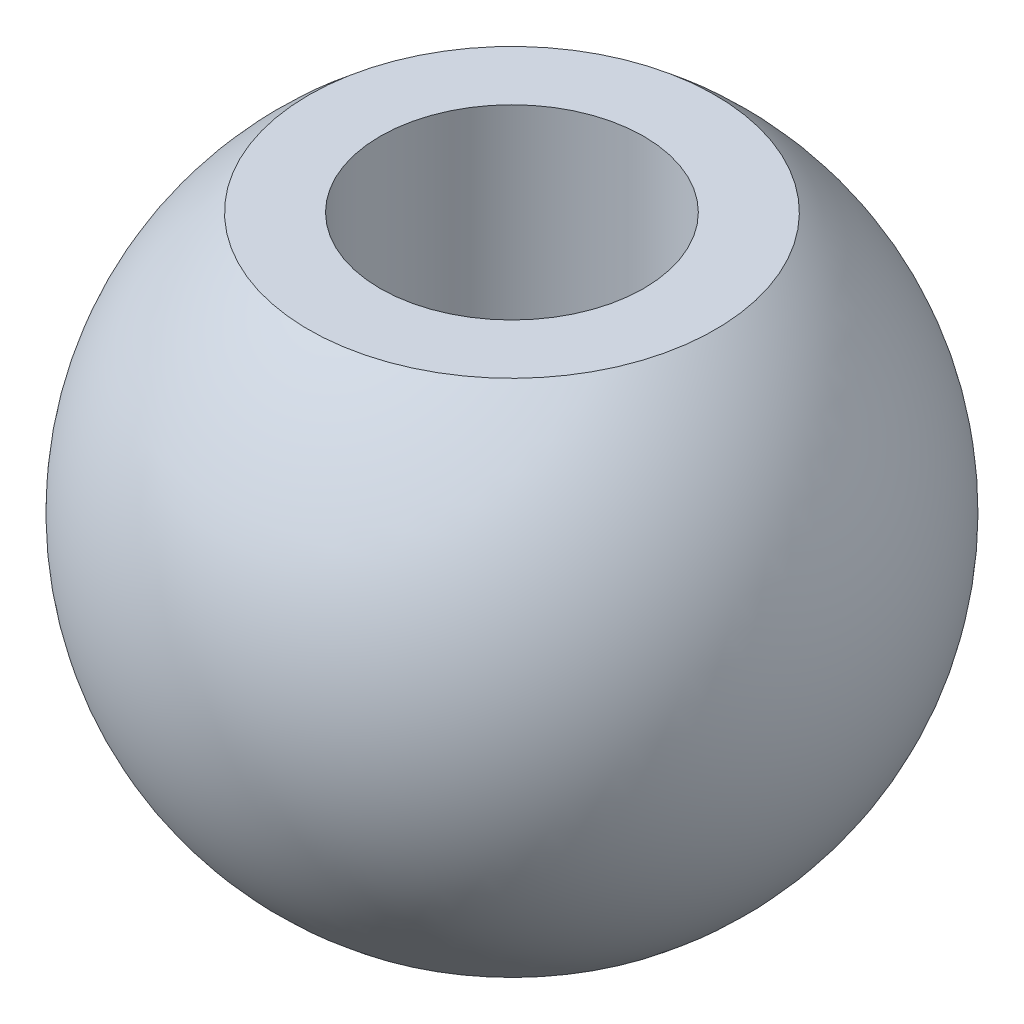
ISO-10303-21;
HEADER;
FILE_DESCRIPTION(('STEP AP214'),'2;1');
FILE_NAME('part.step','',(''),(''),'','','');
FILE_SCHEMA(('AUTOMOTIVE_DESIGN { 1 0 10303 214 1 1 1 1 }'));
ENDSEC;
DATA;
#1=APPLICATION_CONTEXT('core data for automotive mechanical design processes');
#2=APPLICATION_PROTOCOL_DEFINITION('international standard','automotive_design',2000,#1);
#3=PRODUCT_CONTEXT('',#1,'mechanical');
#4=PRODUCT('Part','Part','',(#3));
#5=PRODUCT_RELATED_PRODUCT_CATEGORY('part','',(#4));
#6=PRODUCT_DEFINITION_FORMATION('','',#4);
#7=PRODUCT_DEFINITION_CONTEXT('part definition',#1,'design');
#8=PRODUCT_DEFINITION('design','',#6,#7);
#9=PRODUCT_DEFINITION_SHAPE('','',#8);
#10=(LENGTH_UNIT() NAMED_UNIT(*) SI_UNIT(.MILLI.,.METRE.));
#11=(NAMED_UNIT(*) PLANE_ANGLE_UNIT() SI_UNIT($,.RADIAN.));
#12=(NAMED_UNIT(*) SI_UNIT($,.STERADIAN.) SOLID_ANGLE_UNIT());
#13=UNCERTAINTY_MEASURE_WITH_UNIT(LENGTH_MEASURE(1.E-05),#10,'distance_accuracy_value','');
#14=(GEOMETRIC_REPRESENTATION_CONTEXT(3) GLOBAL_UNCERTAINTY_ASSIGNED_CONTEXT((#13)) GLOBAL_UNIT_ASSIGNED_CONTEXT((#10,
#11,#12)) REPRESENTATION_CONTEXT('',''));
#15=CARTESIAN_POINT('',(0.,0.,0.));
#16=DIRECTION('',(0.,0.,1.));
#17=DIRECTION('',(1.,0.,0.));
#18=AXIS2_PLACEMENT_3D('',#15,#16,#17);
#19=CARTESIAN_POINT('',(0.,0.,0.));
#20=DIRECTION('',(0.,-1.,0.));
#21=DIRECTION('',(0.,0.,-1.));
#22=AXIS2_PLACEMENT_3D('',#19,#20,#21);
#23=CYLINDRICAL_SURFACE('',#22,1.5875);
#24=CARTESIAN_POINT('',(0.,3.1242,0.));
#25=DIRECTION('',(0.,-1.,0.));
#26=DIRECTION('',(0.,0.,-1.));
#27=AXIS2_PLACEMENT_3D('',#24,#25,#26);
#28=CIRCLE('',#27,1.5875);
#29=CARTESIAN_POINT('',(0.,3.1242,-1.5875));
#30=VERTEX_POINT('',#29);
#31=EDGE_CURVE('E10',#30,#30,#28,.T.);
#32=ORIENTED_EDGE('',*,*,#31,.F.);
#33=EDGE_LOOP('',(#32));
#34=FACE_BOUND('',#33,.T.);
#35=CARTESIAN_POINT('',(0.,-3.1242,0.));
#36=DIRECTION('',(0.,-1.,0.));
#37=DIRECTION('',(0.,0.,-1.));
#38=AXIS2_PLACEMENT_3D('',#35,#36,#37);
#39=CIRCLE('',#38,1.5875);
#40=CARTESIAN_POINT('',(0.,-3.1242,-1.5875));
#41=VERTEX_POINT('',#40);
#42=EDGE_CURVE('E54',#41,#41,#39,.T.);
#43=ORIENTED_EDGE('',*,*,#42,.T.);
#44=EDGE_LOOP('',(#43));
#45=FACE_BOUND('',#44,.T.);
#46=ADVANCED_FACE('F36',(#34,#45),#23,.F.);
#47=CARTESIAN_POINT('',(-1.5875,3.1242,0.));
#48=DIRECTION('',(0.,-1.,0.));
#49=DIRECTION('',(0.,0.,-1.));
#50=AXIS2_PLACEMENT_3D('',#47,#48,#49);
#51=PLANE('',#50);
#52=CARTESIAN_POINT('',(0.,3.1242,0.));
#53=DIRECTION('',(0.,-1.,0.));
#54=DIRECTION('',(0.,0.,-1.));
#55=AXIS2_PLACEMENT_3D('',#52,#53,#54);
#56=CIRCLE('',#55,2.44751934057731);
#57=CARTESIAN_POINT('',(-2.44751934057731,3.1242,0.));
#58=VERTEX_POINT('',#57);
#59=EDGE_CURVE('E43',#58,#58,#56,.T.);
#60=ORIENTED_EDGE('',*,*,#59,.F.);
#61=EDGE_LOOP('',(#60));
#62=FACE_BOUND('',#61,.T.);
#63=ORIENTED_EDGE('',*,*,#31,.T.);
#64=EDGE_LOOP('',(#63));
#65=FACE_BOUND('',#64,.T.);
#66=ADVANCED_FACE('F69',(#62,#65),#51,.F.);
#67=CARTESIAN_POINT('',(0.,0.,0.));
#68=DIRECTION('',(0.,-1.,0.));
#69=DIRECTION('',(-1.,0.,0.));
#70=AXIS2_PLACEMENT_3D('',#67,#68,#69);
#71=SPHERICAL_SURFACE('',#70,3.96875);
#72=CARTESIAN_POINT('',(0.,-3.1242,0.));
#73=DIRECTION('',(0.,-1.,0.));
#74=DIRECTION('',(0.,0.,-1.));
#75=AXIS2_PLACEMENT_3D('',#72,#73,#74);
#76=CIRCLE('',#75,2.44751934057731);
#77=CARTESIAN_POINT('',(-2.44751934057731,-3.1242,0.));
#78=VERTEX_POINT('',#77);
#79=EDGE_CURVE('E49',#78,#78,#76,.T.);
#80=CARTESIAN_POINT('',(-2.44751934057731,-3.1242,0.));
#81=CARTESIAN_POINT('',(-2.50650685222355,-3.0779918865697,0.));
#82=CARTESIAN_POINT('',(-2.56418252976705,-3.03010963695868,0.));
#83=CARTESIAN_POINT('',(-2.67673231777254,-2.93115850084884,0.));
#84=CARTESIAN_POINT('',(-2.73160642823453,-2.88008961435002,0.));
#85=CARTESIAN_POINT('',(-2.83837518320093,-2.77492683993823,0.));
#86=CARTESIAN_POINT('',(-2.89026982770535,-2.72083295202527,0.));
#87=CARTESIAN_POINT('',(-2.99091371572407,-2.60979425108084,0.));
#88=CARTESIAN_POINT('',(-3.03966295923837,-2.55284943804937,0.));
#89=CARTESIAN_POINT('',(-3.13385955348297,-2.43629137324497,0.));
#90=CARTESIAN_POINT('',(-3.17930690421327,-2.37667812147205,0.));
#91=CARTESIAN_POINT('',(-3.26675398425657,-2.25497442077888,0.));
#92=CARTESIAN_POINT('',(-3.30875371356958,-2.19288397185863,0.));
#93=CARTESIAN_POINT('',(-3.38917083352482,-2.0664250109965,0.));
#94=CARTESIAN_POINT('',(-3.42758822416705,-2.00205649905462,0.));
#95=CARTESIAN_POINT('',(-3.50071745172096,-1.87124786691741,0.));
#96=CARTESIAN_POINT('',(-3.53542928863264,-1.80480774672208,0.));
#97=CARTESIAN_POINT('',(-3.60103607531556,-1.67006899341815,0.));
#98=CARTESIAN_POINT('',(-3.6319310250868,-1.60177036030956,0.));
#99=CARTESIAN_POINT('',(-3.68980494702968,-1.46353363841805,0.));
#100=CARTESIAN_POINT('',(-3.71678391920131,-1.39359554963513,0.));
#101=CARTESIAN_POINT('',(-3.76673935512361,-1.25230423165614,0.));
#102=CARTESIAN_POINT('',(-3.78971581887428,-1.18095100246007,0.));
#103=CARTESIAN_POINT('',(-3.83159254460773,-1.03705825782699,0.));
#104=CARTESIAN_POINT('',(-3.8504928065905,-0.964518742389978,0.));
#105=CARTESIAN_POINT('',(-3.88415650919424,-0.818486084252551,0.));
#106=CARTESIAN_POINT('',(-3.89891994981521,-0.744992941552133,0.));
#107=CARTESIAN_POINT('',(-3.92426265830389,-0.597288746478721,0.));
#108=CARTESIAN_POINT('',(-3.9348419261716,-0.523077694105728,0.));
#109=CARTESIAN_POINT('',(-3.95178235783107,-0.374175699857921,0.));
#110=CARTESIAN_POINT('',(-3.95814352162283,-0.299484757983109,0.));
#111=CARTESIAN_POINT('',(-3.96662734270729,-0.149862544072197,0.));
#112=CARTESIAN_POINT('',(-3.96875,-0.0749312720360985,0.));
#113=CARTESIAN_POINT('',(-3.96875,0.0749312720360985,0.));
#114=CARTESIAN_POINT('',(-3.96662734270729,0.149862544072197,0.));
#115=CARTESIAN_POINT('',(-3.95814352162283,0.299484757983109,0.));
#116=CARTESIAN_POINT('',(-3.95178235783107,0.374175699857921,0.));
#117=CARTESIAN_POINT('',(-3.9348419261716,0.523077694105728,0.));
#118=CARTESIAN_POINT('',(-3.92426265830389,0.597288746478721,0.));
#119=CARTESIAN_POINT('',(-3.89891994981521,0.744992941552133,0.));
#120=CARTESIAN_POINT('',(-3.88415650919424,0.818486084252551,0.));
#121=CARTESIAN_POINT('',(-3.8504928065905,0.964518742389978,0.));
#122=CARTESIAN_POINT('',(-3.83159254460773,1.03705825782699,0.));
#123=CARTESIAN_POINT('',(-3.78971581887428,1.18095100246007,0.));
#124=CARTESIAN_POINT('',(-3.76673935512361,1.25230423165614,0.));
#125=CARTESIAN_POINT('',(-3.71678391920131,1.39359554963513,0.));
#126=CARTESIAN_POINT('',(-3.68980494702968,1.46353363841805,0.));
#127=CARTESIAN_POINT('',(-3.6319310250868,1.60177036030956,0.));
#128=CARTESIAN_POINT('',(-3.60103607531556,1.67006899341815,0.));
#129=CARTESIAN_POINT('',(-3.53542928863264,1.80480774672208,0.));
#130=CARTESIAN_POINT('',(-3.50071745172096,1.87124786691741,0.));
#131=CARTESIAN_POINT('',(-3.42758822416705,2.00205649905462,0.));
#132=CARTESIAN_POINT('',(-3.38917083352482,2.0664250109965,0.));
#133=CARTESIAN_POINT('',(-3.30875371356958,2.19288397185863,0.));
#134=CARTESIAN_POINT('',(-3.26675398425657,2.25497442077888,0.));
#135=CARTESIAN_POINT('',(-3.17930690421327,2.37667812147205,0.));
#136=CARTESIAN_POINT('',(-3.13385955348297,2.43629137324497,0.));
#137=CARTESIAN_POINT('',(-3.03966295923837,2.55284943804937,0.));
#138=CARTESIAN_POINT('',(-2.99091371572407,2.60979425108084,0.));
#139=CARTESIAN_POINT('',(-2.89026982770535,2.72083295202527,0.));
#140=CARTESIAN_POINT('',(-2.83837518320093,2.77492683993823,0.));
#141=CARTESIAN_POINT('',(-2.73160642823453,2.88008961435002,0.));
#142=CARTESIAN_POINT('',(-2.67673231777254,2.93115850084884,0.));
#143=CARTESIAN_POINT('',(-2.56418252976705,3.03010963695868,0.));
#144=CARTESIAN_POINT('',(-2.50650685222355,3.0779918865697,0.));
#145=CARTESIAN_POINT('',(-2.44751934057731,3.1242,0.));
#146=B_SPLINE_CURVE_WITH_KNOTS('',3,(#80,#81,#82,#83,#84,#85,#86,#87,#88,#89,#90,#91,#92,#93,
#94,#95,#96,#97,#98,#99,#100,#101,#102,#103,#104,#105,#106,#107,#108,#109,#110,#111,#112,#113,
#114,#115,#116,#117,#118,#119,#120,#121,#122,#123,#124,#125,#126,#127,#128,#129,#130,#131,#132,
#133,#134,#135,#136,#137,#138,#139,#140,#141,#142,#143,#144,#145),.UNSPECIFIED.,.F.,.F.,(4,2,2,
2,2,2,2,2,2,2,2,2,2,2,2,2,2,2,2,2,2,2,2,2,2,2,2,2,2,2,2,2,4),(0.,0.224763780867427,
0.449527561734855,0.674291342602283,0.89905512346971,1.12381890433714,1.34858268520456,
1.57334646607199,1.79811024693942,2.02287402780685,2.24763780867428,2.4724015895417,
2.69716537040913,2.92192915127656,3.14669293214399,3.37145671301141,3.59622049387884,
3.82098427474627,4.0457480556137,4.27051183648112,4.49527561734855,4.72003939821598,
4.94480317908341,5.16956695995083,5.39433074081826,5.61909452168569,5.84385830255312,
6.06862208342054,6.29338586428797,6.5181496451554,6.74291342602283,6.96767720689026,
7.19244098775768),.UNSPECIFIED.);
#147=EDGE_CURVE('BSEAM64',#78,#58,#146,.T.);
#148=ORIENTED_EDGE('',*,*,#79,.F.);
#149=ORIENTED_EDGE('',*,*,#59,.T.);
#150=ORIENTED_EDGE('',*,*,#147,.T.);
#151=ORIENTED_EDGE('',*,*,#147,.F.);
#152=EDGE_LOOP('',(#148,#150,#149,#151));
#153=FACE_BOUND('',#152,.T.);
#154=ADVANCED_FACE('F64',(#153),#71,.T.);
#155=CARTESIAN_POINT('',(-1.5875,-3.1242,0.));
#156=DIRECTION('',(0.,1.,0.));
#157=DIRECTION('',(0.,0.,1.));
#158=AXIS2_PLACEMENT_3D('',#155,#156,#157);
#159=PLANE('',#158);
#160=ORIENTED_EDGE('',*,*,#42,.F.);
#161=EDGE_LOOP('',(#160));
#162=FACE_BOUND('',#161,.T.);
#163=ORIENTED_EDGE('',*,*,#79,.T.);
#164=EDGE_LOOP('',(#163));
#165=FACE_BOUND('',#164,.T.);
#166=ADVANCED_FACE('F61',(#162,#165),#159,.F.);
#167=CLOSED_SHELL('',(#46,#66,#154,#166));
#168=MANIFOLD_SOLID_BREP('B2',#167);
#169=ADVANCED_BREP_SHAPE_REPRESENTATION('',(#18,#168),#14);
#170=SHAPE_DEFINITION_REPRESENTATION(#9,#169);
ENDSEC;
END-ISO-10303-21;
